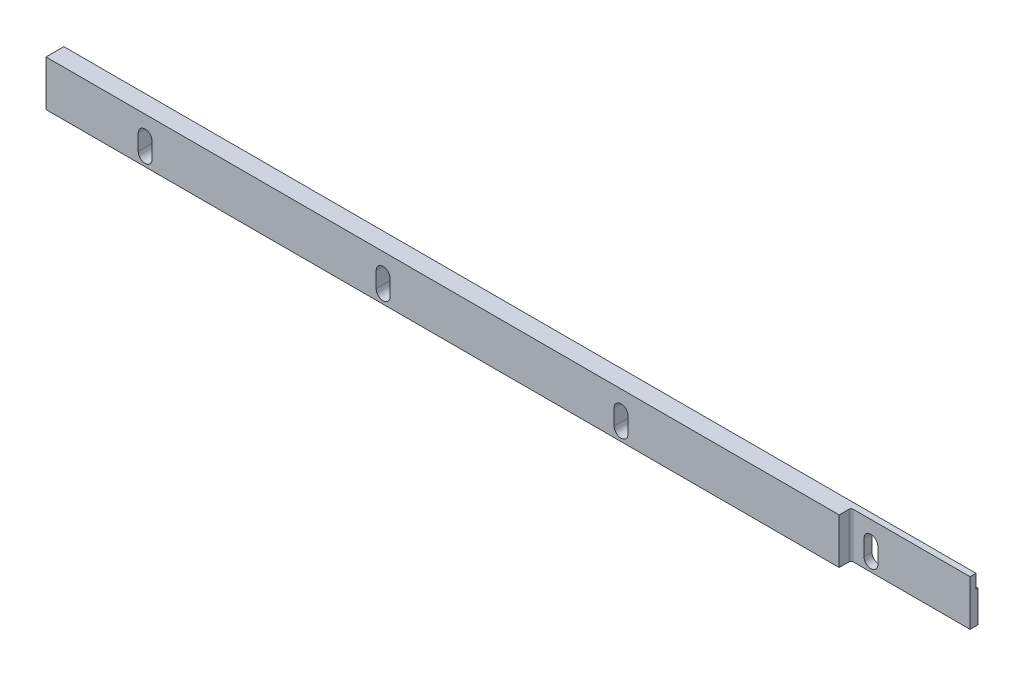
ISO-10303-21;
HEADER;
FILE_DESCRIPTION(('STEP AP214'),'2;1');
FILE_NAME('part.step','',(''),(''),'','','');
FILE_SCHEMA(('AUTOMOTIVE_DESIGN { 1 0 10303 214 1 1 1 1 }'));
ENDSEC;
DATA;
#1=APPLICATION_CONTEXT('core data for automotive mechanical design processes');
#2=APPLICATION_PROTOCOL_DEFINITION('international standard','automotive_design',2000,#1);
#3=PRODUCT_CONTEXT('',#1,'mechanical');
#4=PRODUCT('Part','Part','',(#3));
#5=PRODUCT_RELATED_PRODUCT_CATEGORY('part','',(#4));
#6=PRODUCT_DEFINITION_FORMATION('','',#4);
#7=PRODUCT_DEFINITION_CONTEXT('part definition',#1,'design');
#8=PRODUCT_DEFINITION('design','',#6,#7);
#9=PRODUCT_DEFINITION_SHAPE('','',#8);
#10=(LENGTH_UNIT() NAMED_UNIT(*) SI_UNIT(.MILLI.,.METRE.));
#11=(NAMED_UNIT(*) PLANE_ANGLE_UNIT() SI_UNIT($,.RADIAN.));
#12=(NAMED_UNIT(*) SI_UNIT($,.STERADIAN.) SOLID_ANGLE_UNIT());
#13=UNCERTAINTY_MEASURE_WITH_UNIT(LENGTH_MEASURE(1.E-05),#10,'distance_accuracy_value','');
#14=(GEOMETRIC_REPRESENTATION_CONTEXT(3) GLOBAL_UNCERTAINTY_ASSIGNED_CONTEXT((#13)) GLOBAL_UNIT_ASSIGNED_CONTEXT((#10,
#11,#12)) REPRESENTATION_CONTEXT('',''));
#15=CARTESIAN_POINT('',(0.,0.,0.));
#16=DIRECTION('',(0.,0.,1.));
#17=DIRECTION('',(1.,0.,0.));
#18=AXIS2_PLACEMENT_3D('',#15,#16,#17);
#19=CARTESIAN_POINT('',(0.,-13.3541654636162,5.));
#20=DIRECTION('',(-1.,0.,0.));
#21=DIRECTION('',(0.,-1.,0.));
#22=AXIS2_PLACEMENT_3D('',#19,#20,#21);
#23=PLANE('',#22);
#24=DIRECTION('',(0.,0.,-1.));
#25=VECTOR('',#24,1.);
#26=CARTESIAN_POINT('',(0.,-1.85416546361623,5.));
#27=LINE('',#26,#25);
#28=CARTESIAN_POINT('',(0.,-1.85416546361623,2.));
#29=VERTEX_POINT('',#28);
#30=CARTESIAN_POINT('',(0.,-1.85416546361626,0.5));
#31=VERTEX_POINT('',#30);
#32=EDGE_CURVE('E244',#29,#31,#27,.T.);
#33=ORIENTED_EDGE('',*,*,#32,.F.);
#34=DIRECTION('',(0.,1.,0.));
#35=VECTOR('',#34,1.);
#36=CARTESIAN_POINT('',(0.,-13.3541654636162,2.));
#37=LINE('',#36,#35);
#38=CARTESIAN_POINT('',(0.,-13.3541654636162,2.));
#39=VERTEX_POINT('',#38);
#40=EDGE_CURVE('E231',#39,#29,#37,.T.);
#41=ORIENTED_EDGE('',*,*,#40,.F.);
#42=DIRECTION('',(0.,0.,-1.));
#43=VECTOR('',#42,1.);
#44=CARTESIAN_POINT('',(0.,-13.3541654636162,5.));
#45=LINE('',#44,#43);
#46=CARTESIAN_POINT('',(0.,-13.3541654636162,0.));
#47=VERTEX_POINT('',#46);
#48=EDGE_CURVE('E241',#39,#47,#45,.T.);
#49=ORIENTED_EDGE('',*,*,#48,.T.);
#50=DIRECTION('',(0.,1.,0.));
#51=VECTOR('',#50,1.);
#52=CARTESIAN_POINT('',(0.,-13.3541654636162,0.));
#53=LINE('',#52,#51);
#54=CARTESIAN_POINT('',(0.,-5.35416546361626,0.));
#55=VERTEX_POINT('',#54);
#56=EDGE_CURVE('E472',#47,#55,#53,.T.);
#57=ORIENTED_EDGE('',*,*,#56,.T.);
#58=DIRECTION('',(0.,0.,1.));
#59=VECTOR('',#58,1.);
#60=CARTESIAN_POINT('',(0.,-5.35416546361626,0.));
#61=LINE('',#60,#59);
#62=CARTESIAN_POINT('',(0.,-5.35416546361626,0.5));
#63=VERTEX_POINT('',#62);
#64=EDGE_CURVE('E308',#55,#63,#61,.T.);
#65=ORIENTED_EDGE('',*,*,#64,.T.);
#66=DIRECTION('',(0.,1.,0.));
#67=VECTOR('',#66,1.);
#68=CARTESIAN_POINT('',(0.,-1.85416546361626,0.5));
#69=LINE('',#68,#67);
#70=EDGE_CURVE('E311',#63,#31,#69,.T.);
#71=ORIENTED_EDGE('',*,*,#70,.T.);
#72=EDGE_LOOP('',(#33,#41,#49,#57,#65,#71));
#73=FACE_BOUND('',#72,.T.);
#74=ADVANCED_FACE('F16',(#73),#23,.F.);
#75=CARTESIAN_POINT('',(0.,-1.85416546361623,5.));
#76=DIRECTION('',(0.,-1.,0.));
#77=DIRECTION('',(1.,0.,0.));
#78=AXIS2_PLACEMENT_3D('',#75,#76,#77);
#79=PLANE('',#78);
#80=DIRECTION('',(-1.,0.,0.));
#81=VECTOR('',#80,1.);
#82=CARTESIAN_POINT('',(0.,-1.85416546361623,5.));
#83=LINE('',#82,#81);
#84=CARTESIAN_POINT('',(-30.,-1.85416546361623,5.));
#85=VERTEX_POINT('',#84);
#86=CARTESIAN_POINT('',(-230.,-1.85416546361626,5.));
#87=VERTEX_POINT('',#86);
#88=EDGE_CURVE('E291',#85,#87,#83,.T.);
#89=ORIENTED_EDGE('',*,*,#88,.F.);
#90=DIRECTION('',(0.,0.,1.));
#91=VECTOR('',#90,1.);
#92=CARTESIAN_POINT('',(-30.,-1.85416546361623,5.));
#93=LINE('',#92,#91);
#94=CARTESIAN_POINT('',(-30.,-1.85416546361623,2.5));
#95=VERTEX_POINT('',#94);
#96=EDGE_CURVE('E236',#95,#85,#93,.T.);
#97=ORIENTED_EDGE('',*,*,#96,.F.);
#98=CARTESIAN_POINT('',(-29.5,-1.85416546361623,2.5));
#99=DIRECTION('',(0.,-1.,0.));
#100=DIRECTION('',(1.,0.,0.));
#101=AXIS2_PLACEMENT_3D('',#98,#99,#100);
#102=CIRCLE('',#101,0.5);
#103=CARTESIAN_POINT('',(-29.5,-1.85416546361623,2.));
#104=VERTEX_POINT('',#103);
#105=EDGE_CURVE('E24',#95,#104,#102,.T.);
#106=ORIENTED_EDGE('',*,*,#105,.T.);
#107=DIRECTION('',(-1.,0.,0.));
#108=VECTOR('',#107,1.);
#109=CARTESIAN_POINT('',(0.,-1.85416546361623,2.));
#110=LINE('',#109,#108);
#111=EDGE_CURVE('E292',#29,#104,#110,.T.);
#112=ORIENTED_EDGE('',*,*,#111,.F.);
#113=ORIENTED_EDGE('',*,*,#32,.T.);
#114=DIRECTION('',(-1.,0.,0.));
#115=VECTOR('',#114,1.);
#116=CARTESIAN_POINT('',(0.,-1.85416546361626,0.5));
#117=LINE('',#116,#115);
#118=CARTESIAN_POINT('',(-230.,-1.85416546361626,0.5));
#119=VERTEX_POINT('',#118);
#120=EDGE_CURVE('E318',#31,#119,#117,.T.);
#121=ORIENTED_EDGE('',*,*,#120,.T.);
#122=DIRECTION('',(0.,0.,-1.));
#123=VECTOR('',#122,1.);
#124=CARTESIAN_POINT('',(-230.,-1.85416546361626,5.));
#125=LINE('',#124,#123);
#126=EDGE_CURVE('E255',#87,#119,#125,.T.);
#127=ORIENTED_EDGE('',*,*,#126,.F.);
#128=EDGE_LOOP('',(#89,#97,#106,#112,#113,#121,#127));
#129=FACE_BOUND('',#128,.T.);
#130=ADVANCED_FACE('F289',(#129),#79,.F.);
#131=CARTESIAN_POINT('',(-230.,-13.3541654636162,5.));
#132=DIRECTION('',(1.,0.,0.));
#133=DIRECTION('',(0.,0.,-1.));
#134=AXIS2_PLACEMENT_3D('',#131,#132,#133);
#135=PLANE('',#134);
#136=ORIENTED_EDGE('',*,*,#126,.T.);
#137=DIRECTION('',(0.,1.,0.));
#138=VECTOR('',#137,1.);
#139=CARTESIAN_POINT('',(-230.,-1.85416546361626,0.5));
#140=LINE('',#139,#138);
#141=CARTESIAN_POINT('',(-230.,-5.35416546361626,0.5));
#142=VERTEX_POINT('',#141);
#143=EDGE_CURVE('E312',#142,#119,#140,.T.);
#144=ORIENTED_EDGE('',*,*,#143,.F.);
#145=DIRECTION('',(0.,0.,1.));
#146=VECTOR('',#145,1.);
#147=CARTESIAN_POINT('',(-230.,-5.35416546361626,0.));
#148=LINE('',#147,#146);
#149=CARTESIAN_POINT('',(-230.,-5.35416546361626,0.));
#150=VERTEX_POINT('',#149);
#151=EDGE_CURVE('E307',#150,#142,#148,.T.);
#152=ORIENTED_EDGE('',*,*,#151,.F.);
#153=DIRECTION('',(0.,-1.,0.));
#154=VECTOR('',#153,1.);
#155=CARTESIAN_POINT('',(-230.,-13.3541654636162,0.));
#156=LINE('',#155,#154);
#157=CARTESIAN_POINT('',(-230.,-13.3541654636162,0.));
#158=VERTEX_POINT('',#157);
#159=EDGE_CURVE('E483',#150,#158,#156,.T.);
#160=ORIENTED_EDGE('',*,*,#159,.T.);
#161=DIRECTION('',(0.,0.,-1.));
#162=VECTOR('',#161,1.);
#163=CARTESIAN_POINT('',(-230.,-13.3541654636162,5.));
#164=LINE('',#163,#162);
#165=CARTESIAN_POINT('',(-230.,-13.3541654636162,5.));
#166=VERTEX_POINT('',#165);
#167=EDGE_CURVE('E252',#166,#158,#164,.T.);
#168=ORIENTED_EDGE('',*,*,#167,.F.);
#169=DIRECTION('',(0.,-1.,0.));
#170=VECTOR('',#169,1.);
#171=CARTESIAN_POINT('',(-230.,-13.3541654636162,5.));
#172=LINE('',#171,#170);
#173=EDGE_CURVE('E258',#87,#166,#172,.T.);
#174=ORIENTED_EDGE('',*,*,#173,.F.);
#175=EDGE_LOOP('',(#136,#144,#152,#160,#168,#174));
#176=FACE_BOUND('',#175,.T.);
#177=ADVANCED_FACE('F488',(#176),#135,.F.);
#178=CARTESIAN_POINT('',(0.,-13.3541654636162,5.));
#179=DIRECTION('',(0.,1.,0.));
#180=DIRECTION('',(0.,0.,1.));
#181=AXIS2_PLACEMENT_3D('',#178,#179,#180);
#182=PLANE('',#181);
#183=DIRECTION('',(-1.,0.,0.));
#184=VECTOR('',#183,1.);
#185=CARTESIAN_POINT('',(0.,-13.3541654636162,2.));
#186=LINE('',#185,#184);
#187=CARTESIAN_POINT('',(-29.5,-13.3541654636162,2.));
#188=VERTEX_POINT('',#187);
#189=EDGE_CURVE('E227',#39,#188,#186,.T.);
#190=ORIENTED_EDGE('',*,*,#189,.T.);
#191=CARTESIAN_POINT('',(-29.5,-13.3541654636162,2.5));
#192=DIRECTION('',(0.,1.,0.));
#193=DIRECTION('',(0.,0.,1.));
#194=AXIS2_PLACEMENT_3D('',#191,#192,#193);
#195=CIRCLE('',#194,0.5);
#196=CARTESIAN_POINT('',(-30.,-13.3541654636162,2.5));
#197=VERTEX_POINT('',#196);
#198=EDGE_CURVE('E11',#188,#197,#195,.T.);
#199=ORIENTED_EDGE('',*,*,#198,.T.);
#200=DIRECTION('',(0.,0.,1.));
#201=VECTOR('',#200,1.);
#202=CARTESIAN_POINT('',(-30.,-13.3541654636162,5.));
#203=LINE('',#202,#201);
#204=CARTESIAN_POINT('',(-30.,-13.3541654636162,5.));
#205=VERTEX_POINT('',#204);
#206=EDGE_CURVE('E235',#197,#205,#203,.T.);
#207=ORIENTED_EDGE('',*,*,#206,.T.);
#208=DIRECTION('',(1.,0.,0.));
#209=VECTOR('',#208,1.);
#210=CARTESIAN_POINT('',(0.,-13.3541654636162,5.));
#211=LINE('',#210,#209);
#212=EDGE_CURVE('E253',#166,#205,#211,.T.);
#213=ORIENTED_EDGE('',*,*,#212,.F.);
#214=ORIENTED_EDGE('',*,*,#167,.T.);
#215=DIRECTION('',(1.,0.,0.));
#216=VECTOR('',#215,1.);
#217=CARTESIAN_POINT('',(0.,-13.3541654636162,0.));
#218=LINE('',#217,#216);
#219=EDGE_CURVE('E250',#158,#47,#218,.T.);
#220=ORIENTED_EDGE('',*,*,#219,.T.);
#221=ORIENTED_EDGE('',*,*,#48,.F.);
#222=EDGE_LOOP('',(#190,#199,#207,#213,#214,#220,#221));
#223=FACE_BOUND('',#222,.T.);
#224=ADVANCED_FACE('F247',(#223),#182,.F.);
#225=CARTESIAN_POINT('',(0.,0.,5.));
#226=DIRECTION('',(0.,0.,1.));
#227=DIRECTION('',(1.,0.,0.));
#228=AXIS2_PLACEMENT_3D('',#225,#226,#227);
#229=PLANE('',#228);
#230=DIRECTION('',(0.,1.,0.));
#231=VECTOR('',#230,1.);
#232=CARTESIAN_POINT('',(-30.,-13.3541654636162,5.));
#233=LINE('',#232,#231);
#234=EDGE_CURVE('E245',#205,#85,#233,.T.);
#235=ORIENTED_EDGE('',*,*,#234,.T.);
#236=ORIENTED_EDGE('',*,*,#88,.T.);
#237=ORIENTED_EDGE('',*,*,#173,.T.);
#238=ORIENTED_EDGE('',*,*,#212,.T.);
#239=EDGE_LOOP('',(#235,#236,#237,#238));
#240=FACE_BOUND('',#239,.T.);
#241=CARTESIAN_POINT('',(-205.,-6.85416546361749,5.));
#242=DIRECTION('',(0.,0.,1.));
#243=DIRECTION('',(1.,0.,0.));
#244=AXIS2_PLACEMENT_3D('',#241,#242,#243);
#245=CIRCLE('',#244,1.75000000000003);
#246=CARTESIAN_POINT('',(-203.25,-6.85416546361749,5.));
#247=VERTEX_POINT('',#246);
#248=CARTESIAN_POINT('',(-206.75,-6.85416546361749,5.));
#249=VERTEX_POINT('',#248);
#250=EDGE_CURVE('E356',#247,#249,#245,.T.);
#251=ORIENTED_EDGE('',*,*,#250,.F.);
#252=DIRECTION('',(0.,1.,0.));
#253=VECTOR('',#252,1.);
#254=CARTESIAN_POINT('',(-203.25,-6.85416546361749,5.));
#255=LINE('',#254,#253);
#256=CARTESIAN_POINT('',(-203.25,-10.8541654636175,5.));
#257=VERTEX_POINT('',#256);
#258=EDGE_CURVE('E378',#257,#247,#255,.T.);
#259=ORIENTED_EDGE('',*,*,#258,.F.);
#260=CARTESIAN_POINT('',(-205.,-10.8541654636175,5.));
#261=DIRECTION('',(0.,0.,1.));
#262=DIRECTION('',(1.,0.,0.));
#263=AXIS2_PLACEMENT_3D('',#260,#261,#262);
#264=CIRCLE('',#263,1.75000000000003);
#265=CARTESIAN_POINT('',(-206.75,-10.8541654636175,5.));
#266=VERTEX_POINT('',#265);
#267=EDGE_CURVE('E375',#266,#257,#264,.T.);
#268=ORIENTED_EDGE('',*,*,#267,.F.);
#269=DIRECTION('',(0.,-1.,0.));
#270=VECTOR('',#269,1.);
#271=CARTESIAN_POINT('',(-206.75,-6.85416546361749,5.));
#272=LINE('',#271,#270);
#273=EDGE_CURVE('E372',#249,#266,#272,.T.);
#274=ORIENTED_EDGE('',*,*,#273,.F.);
#275=EDGE_LOOP('',(#251,#259,#268,#274));
#276=FACE_BOUND('',#275,.T.);
#277=CARTESIAN_POINT('',(-145.,-6.85416546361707,5.));
#278=DIRECTION('',(0.,0.,1.));
#279=DIRECTION('',(1.,0.,0.));
#280=AXIS2_PLACEMENT_3D('',#277,#278,#279);
#281=CIRCLE('',#280,1.75000000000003);
#282=CARTESIAN_POINT('',(-143.25,-6.85416546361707,5.));
#283=VERTEX_POINT('',#282);
#284=CARTESIAN_POINT('',(-146.75,-6.85416546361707,5.));
#285=VERTEX_POINT('',#284);
#286=EDGE_CURVE('E383',#283,#285,#281,.T.);
#287=ORIENTED_EDGE('',*,*,#286,.F.);
#288=DIRECTION('',(0.,1.,0.));
#289=VECTOR('',#288,1.);
#290=CARTESIAN_POINT('',(-143.25,-6.85416546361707,5.));
#291=LINE('',#290,#289);
#292=CARTESIAN_POINT('',(-143.25,-10.8541654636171,5.));
#293=VERTEX_POINT('',#292);
#294=EDGE_CURVE('E411',#293,#283,#291,.T.);
#295=ORIENTED_EDGE('',*,*,#294,.F.);
#296=CARTESIAN_POINT('',(-145.,-10.8541654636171,5.));
#297=DIRECTION('',(0.,0.,1.));
#298=DIRECTION('',(1.,0.,0.));
#299=AXIS2_PLACEMENT_3D('',#296,#297,#298);
#300=CIRCLE('',#299,1.75000000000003);
#301=CARTESIAN_POINT('',(-146.75,-10.8541654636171,5.));
#302=VERTEX_POINT('',#301);
#303=EDGE_CURVE('E408',#302,#293,#300,.T.);
#304=ORIENTED_EDGE('',*,*,#303,.F.);
#305=DIRECTION('',(0.,-1.,0.));
#306=VECTOR('',#305,1.);
#307=CARTESIAN_POINT('',(-146.75,-6.85416546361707,5.));
#308=LINE('',#307,#306);
#309=EDGE_CURVE('E405',#285,#302,#308,.T.);
#310=ORIENTED_EDGE('',*,*,#309,.F.);
#311=EDGE_LOOP('',(#287,#295,#304,#310));
#312=FACE_BOUND('',#311,.T.);
#313=CARTESIAN_POINT('',(-85.,-6.85416546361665,5.));
#314=DIRECTION('',(0.,0.,1.));
#315=DIRECTION('',(1.,0.,0.));
#316=AXIS2_PLACEMENT_3D('',#313,#314,#315);
#317=CIRCLE('',#316,1.75);
#318=CARTESIAN_POINT('',(-83.25,-6.85416546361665,5.));
#319=VERTEX_POINT('',#318);
#320=CARTESIAN_POINT('',(-86.75,-6.85416546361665,5.));
#321=VERTEX_POINT('',#320);
#322=EDGE_CURVE('E416',#319,#321,#317,.T.);
#323=ORIENTED_EDGE('',*,*,#322,.F.);
#324=DIRECTION('',(0.,1.,0.));
#325=VECTOR('',#324,1.);
#326=CARTESIAN_POINT('',(-83.25,-6.85416546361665,5.));
#327=LINE('',#326,#325);
#328=CARTESIAN_POINT('',(-83.25,-10.8541654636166,5.));
#329=VERTEX_POINT('',#328);
#330=EDGE_CURVE('E444',#329,#319,#327,.T.);
#331=ORIENTED_EDGE('',*,*,#330,.F.);
#332=CARTESIAN_POINT('',(-85.,-10.8541654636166,5.));
#333=DIRECTION('',(0.,0.,1.));
#334=DIRECTION('',(1.,0.,0.));
#335=AXIS2_PLACEMENT_3D('',#332,#333,#334);
#336=CIRCLE('',#335,1.75);
#337=CARTESIAN_POINT('',(-86.75,-10.8541654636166,5.));
#338=VERTEX_POINT('',#337);
#339=EDGE_CURVE('E441',#338,#329,#336,.T.);
#340=ORIENTED_EDGE('',*,*,#339,.F.);
#341=DIRECTION('',(0.,-1.,0.));
#342=VECTOR('',#341,1.);
#343=CARTESIAN_POINT('',(-86.75,-6.85416546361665,5.));
#344=LINE('',#343,#342);
#345=EDGE_CURVE('E438',#321,#338,#344,.T.);
#346=ORIENTED_EDGE('',*,*,#345,.F.);
#347=EDGE_LOOP('',(#323,#331,#340,#346));
#348=FACE_BOUND('',#347,.T.);
#349=ADVANCED_FACE('F504',(#240,#276,#312,#348),#229,.T.);
#350=CARTESIAN_POINT('',(0.,0.,0.));
#351=DIRECTION('',(0.,0.,1.));
#352=DIRECTION('',(1.,0.,0.));
#353=AXIS2_PLACEMENT_3D('',#350,#351,#352);
#354=PLANE('',#353);
#355=ORIENTED_EDGE('',*,*,#159,.F.);
#356=DIRECTION('',(-1.,0.,0.));
#357=VECTOR('',#356,1.);
#358=CARTESIAN_POINT('',(0.,-5.35416546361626,0.));
#359=LINE('',#358,#357);
#360=CARTESIAN_POINT('',(-205.901387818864,-5.35416546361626,0.));
#361=VERTEX_POINT('',#360);
#362=EDGE_CURVE('E314',#361,#150,#359,.T.);
#363=ORIENTED_EDGE('',*,*,#362,.F.);
#364=CARTESIAN_POINT('',(-205.,-6.85416546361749,0.));
#365=DIRECTION('',(0.,0.,1.));
#366=DIRECTION('',(1.,0.,0.));
#367=AXIS2_PLACEMENT_3D('',#364,#365,#366);
#368=CIRCLE('',#367,1.75000000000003);
#369=CARTESIAN_POINT('',(-206.75,-6.85416546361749,0.));
#370=VERTEX_POINT('',#369);
#371=EDGE_CURVE('E361',#361,#370,#368,.T.);
#372=ORIENTED_EDGE('',*,*,#371,.T.);
#373=DIRECTION('',(0.,-1.,0.));
#374=VECTOR('',#373,1.);
#375=CARTESIAN_POINT('',(-206.75,-6.85416546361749,0.));
#376=LINE('',#375,#374);
#377=CARTESIAN_POINT('',(-206.75,-10.8541654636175,0.));
#378=VERTEX_POINT('',#377);
#379=EDGE_CURVE('E360',#370,#378,#376,.T.);
#380=ORIENTED_EDGE('',*,*,#379,.T.);
#381=CARTESIAN_POINT('',(-205.,-10.8541654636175,0.));
#382=DIRECTION('',(0.,0.,1.));
#383=DIRECTION('',(1.,0.,0.));
#384=AXIS2_PLACEMENT_3D('',#381,#382,#383);
#385=CIRCLE('',#384,1.75000000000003);
#386=CARTESIAN_POINT('',(-203.25,-10.8541654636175,0.));
#387=VERTEX_POINT('',#386);
#388=EDGE_CURVE('E364',#378,#387,#385,.T.);
#389=ORIENTED_EDGE('',*,*,#388,.T.);
#390=DIRECTION('',(0.,1.,0.));
#391=VECTOR('',#390,1.);
#392=CARTESIAN_POINT('',(-203.25,-6.85416546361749,0.));
#393=LINE('',#392,#391);
#394=CARTESIAN_POINT('',(-203.25,-6.85416546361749,0.));
#395=VERTEX_POINT('',#394);
#396=EDGE_CURVE('E367',#387,#395,#393,.T.);
#397=ORIENTED_EDGE('',*,*,#396,.T.);
#398=CARTESIAN_POINT('',(-204.098612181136,-5.35416546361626,0.));
#399=VERTEX_POINT('',#398);
#400=EDGE_CURVE('E357',#395,#399,#368,.T.);
#401=ORIENTED_EDGE('',*,*,#400,.T.);
#402=CARTESIAN_POINT('',(-145.901387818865,-5.35416546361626,0.));
#403=VERTEX_POINT('',#402);
#404=EDGE_CURVE('E543',#403,#399,#359,.T.);
#405=ORIENTED_EDGE('',*,*,#404,.F.);
#406=CARTESIAN_POINT('',(-145.,-6.85416546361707,0.));
#407=DIRECTION('',(0.,0.,1.));
#408=DIRECTION('',(1.,0.,0.));
#409=AXIS2_PLACEMENT_3D('',#406,#407,#408);
#410=CIRCLE('',#409,1.75000000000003);
#411=CARTESIAN_POINT('',(-146.75,-6.85416546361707,0.));
#412=VERTEX_POINT('',#411);
#413=EDGE_CURVE('E394',#403,#412,#410,.T.);
#414=ORIENTED_EDGE('',*,*,#413,.T.);
#415=DIRECTION('',(0.,-1.,0.));
#416=VECTOR('',#415,1.);
#417=CARTESIAN_POINT('',(-146.75,-6.85416546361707,0.));
#418=LINE('',#417,#416);
#419=CARTESIAN_POINT('',(-146.75,-10.8541654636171,0.));
#420=VERTEX_POINT('',#419);
#421=EDGE_CURVE('E393',#412,#420,#418,.T.);
#422=ORIENTED_EDGE('',*,*,#421,.T.);
#423=CARTESIAN_POINT('',(-145.,-10.8541654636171,0.));
#424=DIRECTION('',(0.,0.,1.));
#425=DIRECTION('',(1.,0.,0.));
#426=AXIS2_PLACEMENT_3D('',#423,#424,#425);
#427=CIRCLE('',#426,1.75000000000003);
#428=CARTESIAN_POINT('',(-143.25,-10.8541654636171,0.));
#429=VERTEX_POINT('',#428);
#430=EDGE_CURVE('E397',#420,#429,#427,.T.);
#431=ORIENTED_EDGE('',*,*,#430,.T.);
#432=DIRECTION('',(0.,1.,0.));
#433=VECTOR('',#432,1.);
#434=CARTESIAN_POINT('',(-143.25,-6.85416546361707,0.));
#435=LINE('',#434,#433);
#436=CARTESIAN_POINT('',(-143.25,-6.85416546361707,0.));
#437=VERTEX_POINT('',#436);
#438=EDGE_CURVE('E400',#429,#437,#435,.T.);
#439=ORIENTED_EDGE('',*,*,#438,.T.);
#440=CARTESIAN_POINT('',(-144.098612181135,-5.35416546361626,0.));
#441=VERTEX_POINT('',#440);
#442=EDGE_CURVE('E390',#437,#441,#410,.T.);
#443=ORIENTED_EDGE('',*,*,#442,.T.);
#444=CARTESIAN_POINT('',(-85.9013878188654,-5.35416546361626,0.));
#445=VERTEX_POINT('',#444);
#446=EDGE_CURVE('E530',#445,#441,#359,.T.);
#447=ORIENTED_EDGE('',*,*,#446,.F.);
#448=CARTESIAN_POINT('',(-85.,-6.85416546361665,0.));
#449=DIRECTION('',(0.,0.,1.));
#450=DIRECTION('',(1.,0.,0.));
#451=AXIS2_PLACEMENT_3D('',#448,#449,#450);
#452=CIRCLE('',#451,1.75);
#453=CARTESIAN_POINT('',(-86.75,-6.85416546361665,0.));
#454=VERTEX_POINT('',#453);
#455=EDGE_CURVE('E427',#445,#454,#452,.T.);
#456=ORIENTED_EDGE('',*,*,#455,.T.);
#457=DIRECTION('',(0.,-1.,0.));
#458=VECTOR('',#457,1.);
#459=CARTESIAN_POINT('',(-86.75,-6.85416546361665,0.));
#460=LINE('',#459,#458);
#461=CARTESIAN_POINT('',(-86.75,-10.8541654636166,0.));
#462=VERTEX_POINT('',#461);
#463=EDGE_CURVE('E426',#454,#462,#460,.T.);
#464=ORIENTED_EDGE('',*,*,#463,.T.);
#465=CARTESIAN_POINT('',(-85.,-10.8541654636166,0.));
#466=DIRECTION('',(0.,0.,1.));
#467=DIRECTION('',(1.,0.,0.));
#468=AXIS2_PLACEMENT_3D('',#465,#466,#467);
#469=CIRCLE('',#468,1.75);
#470=CARTESIAN_POINT('',(-83.25,-10.8541654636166,0.));
#471=VERTEX_POINT('',#470);
#472=EDGE_CURVE('E430',#462,#471,#469,.T.);
#473=ORIENTED_EDGE('',*,*,#472,.T.);
#474=DIRECTION('',(0.,1.,0.));
#475=VECTOR('',#474,1.);
#476=CARTESIAN_POINT('',(-83.25,-6.85416546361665,0.));
#477=LINE('',#476,#475);
#478=CARTESIAN_POINT('',(-83.25,-6.85416546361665,0.));
#479=VERTEX_POINT('',#478);
#480=EDGE_CURVE('E433',#471,#479,#477,.T.);
#481=ORIENTED_EDGE('',*,*,#480,.T.);
#482=CARTESIAN_POINT('',(-84.0986121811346,-5.35416546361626,0.));
#483=VERTEX_POINT('',#482);
#484=EDGE_CURVE('E423',#479,#483,#452,.T.);
#485=ORIENTED_EDGE('',*,*,#484,.T.);
#486=CARTESIAN_POINT('',(-25.9013878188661,-5.35416546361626,0.));
#487=VERTEX_POINT('',#486);
#488=EDGE_CURVE('E329',#487,#483,#359,.T.);
#489=ORIENTED_EDGE('',*,*,#488,.F.);
#490=CARTESIAN_POINT('',(-25.,-6.85416546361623,0.));
#491=DIRECTION('',(0.,0.,1.));
#492=DIRECTION('',(1.,0.,0.));
#493=AXIS2_PLACEMENT_3D('',#490,#491,#492);
#494=CIRCLE('',#493,1.75);
#495=CARTESIAN_POINT('',(-26.75,-6.85416546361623,0.));
#496=VERTEX_POINT('',#495);
#497=EDGE_CURVE('E449',#487,#496,#494,.T.);
#498=ORIENTED_EDGE('',*,*,#497,.T.);
#499=DIRECTION('',(0.,-1.,0.));
#500=VECTOR('',#499,1.);
#501=CARTESIAN_POINT('',(-26.75,-6.85416546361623,0.));
#502=LINE('',#501,#500);
#503=CARTESIAN_POINT('',(-26.75,-10.8541654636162,0.));
#504=VERTEX_POINT('',#503);
#505=EDGE_CURVE('E459',#496,#504,#502,.T.);
#506=ORIENTED_EDGE('',*,*,#505,.T.);
#507=CARTESIAN_POINT('',(-25.,-10.8541654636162,0.));
#508=DIRECTION('',(0.,0.,1.));
#509=DIRECTION('',(1.,0.,0.));
#510=AXIS2_PLACEMENT_3D('',#507,#508,#509);
#511=CIRCLE('',#510,1.75);
#512=CARTESIAN_POINT('',(-23.25,-10.8541654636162,0.));
#513=VERTEX_POINT('',#512);
#514=EDGE_CURVE('E462',#504,#513,#511,.T.);
#515=ORIENTED_EDGE('',*,*,#514,.T.);
#516=DIRECTION('',(0.,1.,0.));
#517=VECTOR('',#516,1.);
#518=CARTESIAN_POINT('',(-23.25,-6.85416546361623,0.));
#519=LINE('',#518,#517);
#520=CARTESIAN_POINT('',(-23.25,-6.85416546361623,0.));
#521=VERTEX_POINT('',#520);
#522=EDGE_CURVE('E465',#513,#521,#519,.T.);
#523=ORIENTED_EDGE('',*,*,#522,.T.);
#524=CARTESIAN_POINT('',(-24.098612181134,-5.35416546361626,0.));
#525=VERTEX_POINT('',#524);
#526=EDGE_CURVE('E456',#521,#525,#494,.T.);
#527=ORIENTED_EDGE('',*,*,#526,.T.);
#528=EDGE_CURVE('E327',#55,#525,#359,.T.);
#529=ORIENTED_EDGE('',*,*,#528,.F.);
#530=ORIENTED_EDGE('',*,*,#56,.F.);
#531=ORIENTED_EDGE('',*,*,#219,.F.);
#532=EDGE_LOOP('',(#355,#363,#372,#380,#389,#397,#401,#405,#414,#422,#431,#439,#443,#447,#456,
#464,#473,#481,#485,#489,#498,#506,#515,#523,#527,#529,#530,#531));
#533=FACE_BOUND('',#532,.T.);
#534=ADVANCED_FACE('F494',(#533),#354,.F.);
#535=CARTESIAN_POINT('',(-25.,-6.85416546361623,0.));
#536=DIRECTION('',(0.,0.,1.));
#537=DIRECTION('',(1.,0.,0.));
#538=AXIS2_PLACEMENT_3D('',#535,#536,#537);
#539=CYLINDRICAL_SURFACE('',#538,1.75);
#540=DIRECTION('',(0.,0.,1.));
#541=VECTOR('',#540,1.);
#542=CARTESIAN_POINT('',(-23.25,-6.85416546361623,0.));
#543=LINE('',#542,#541);
#544=CARTESIAN_POINT('',(-23.25,-6.85416546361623,2.));
#545=VERTEX_POINT('',#544);
#546=EDGE_CURVE('E469',#521,#545,#543,.T.);
#547=ORIENTED_EDGE('',*,*,#546,.T.);
#548=CARTESIAN_POINT('',(-25.,-6.85416546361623,2.));
#549=DIRECTION('',(0.,0.,-1.));
#550=DIRECTION('',(-1.,0.,0.));
#551=AXIS2_PLACEMENT_3D('',#548,#549,#550);
#552=CIRCLE('',#551,1.75);
#553=CARTESIAN_POINT('',(-26.75,-6.85416546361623,2.));
#554=VERTEX_POINT('',#553);
#555=EDGE_CURVE('E304',#545,#554,#552,.F.);
#556=ORIENTED_EDGE('',*,*,#555,.T.);
#557=DIRECTION('',(0.,0.,1.));
#558=VECTOR('',#557,1.);
#559=CARTESIAN_POINT('',(-26.75,-6.85416546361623,0.));
#560=LINE('',#559,#558);
#561=EDGE_CURVE('E468',#496,#554,#560,.T.);
#562=ORIENTED_EDGE('',*,*,#561,.F.);
#563=ORIENTED_EDGE('',*,*,#497,.F.);
#564=DIRECTION('',(0.,0.,1.));
#565=VECTOR('',#564,1.);
#566=CARTESIAN_POINT('',(-25.9013878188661,-5.35416546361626,0.));
#567=LINE('',#566,#565);
#568=CARTESIAN_POINT('',(-25.9013878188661,-5.35416546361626,0.5));
#569=VERTEX_POINT('',#568);
#570=EDGE_CURVE('E341',#487,#569,#567,.T.);
#571=ORIENTED_EDGE('',*,*,#570,.T.);
#572=CARTESIAN_POINT('',(-25.,-6.85416546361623,0.5));
#573=DIRECTION('',(0.,0.,1.));
#574=DIRECTION('',(0.,-1.,0.));
#575=AXIS2_PLACEMENT_3D('',#572,#573,#574);
#576=CIRCLE('',#575,1.75);
#577=CARTESIAN_POINT('',(-24.098612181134,-5.35416546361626,0.5));
#578=VERTEX_POINT('',#577);
#579=EDGE_CURVE('E353',#569,#578,#576,.F.);
#580=ORIENTED_EDGE('',*,*,#579,.T.);
#581=DIRECTION('',(0.,0.,1.));
#582=VECTOR('',#581,1.);
#583=CARTESIAN_POINT('',(-24.098612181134,-5.35416546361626,0.));
#584=LINE('',#583,#582);
#585=EDGE_CURVE('E344',#578,#525,#584,.F.);
#586=ORIENTED_EDGE('',*,*,#585,.T.);
#587=ORIENTED_EDGE('',*,*,#526,.F.);
#588=EDGE_LOOP('',(#547,#556,#562,#563,#571,#580,#586,#587));
#589=FACE_BOUND('',#588,.T.);
#590=ADVANCED_FACE('F579',(#589),#539,.F.);
#591=CARTESIAN_POINT('',(-23.25,-6.85416546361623,0.));
#592=DIRECTION('',(1.,0.,0.));
#593=DIRECTION('',(0.,0.,-1.));
#594=AXIS2_PLACEMENT_3D('',#591,#592,#593);
#595=PLANE('',#594);
#596=DIRECTION('',(0.,0.,1.));
#597=VECTOR('',#596,1.);
#598=CARTESIAN_POINT('',(-23.25,-10.8541654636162,0.));
#599=LINE('',#598,#597);
#600=CARTESIAN_POINT('',(-23.25,-10.8541654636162,2.));
#601=VERTEX_POINT('',#600);
#602=EDGE_CURVE('E473',#513,#601,#599,.T.);
#603=ORIENTED_EDGE('',*,*,#602,.T.);
#604=DIRECTION('',(0.,1.,0.));
#605=VECTOR('',#604,1.);
#606=CARTESIAN_POINT('',(-23.25,-6.85416546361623,2.));
#607=LINE('',#606,#605);
#608=EDGE_CURVE('E301',#601,#545,#607,.T.);
#609=ORIENTED_EDGE('',*,*,#608,.T.);
#610=ORIENTED_EDGE('',*,*,#546,.F.);
#611=ORIENTED_EDGE('',*,*,#522,.F.);
#612=EDGE_LOOP('',(#603,#609,#610,#611));
#613=FACE_BOUND('',#612,.T.);
#614=ADVANCED_FACE('F583',(#613),#595,.F.);
#615=CARTESIAN_POINT('',(-25.,-10.8541654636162,0.));
#616=DIRECTION('',(0.,0.,1.));
#617=DIRECTION('',(1.,0.,0.));
#618=AXIS2_PLACEMENT_3D('',#615,#616,#617);
#619=CYLINDRICAL_SURFACE('',#618,1.75);
#620=DIRECTION('',(0.,0.,1.));
#621=VECTOR('',#620,1.);
#622=CARTESIAN_POINT('',(-26.75,-10.8541654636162,0.));
#623=LINE('',#622,#621);
#624=CARTESIAN_POINT('',(-26.75,-10.8541654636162,2.));
#625=VERTEX_POINT('',#624);
#626=EDGE_CURVE('E476',#504,#625,#623,.T.);
#627=ORIENTED_EDGE('',*,*,#626,.T.);
#628=CARTESIAN_POINT('',(-25.,-10.8541654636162,2.));
#629=DIRECTION('',(0.,0.,-1.));
#630=DIRECTION('',(-1.,0.,0.));
#631=AXIS2_PLACEMENT_3D('',#628,#629,#630);
#632=CIRCLE('',#631,1.75);
#633=EDGE_CURVE('E297',#625,#601,#632,.F.);
#634=ORIENTED_EDGE('',*,*,#633,.T.);
#635=ORIENTED_EDGE('',*,*,#602,.F.);
#636=ORIENTED_EDGE('',*,*,#514,.F.);
#637=EDGE_LOOP('',(#627,#634,#635,#636));
#638=FACE_BOUND('',#637,.T.);
#639=ADVANCED_FACE('F588',(#638),#619,.F.);
#640=CARTESIAN_POINT('',(-26.75,-6.85416546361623,0.));
#641=DIRECTION('',(-1.,0.,0.));
#642=DIRECTION('',(0.,0.,1.));
#643=AXIS2_PLACEMENT_3D('',#640,#641,#642);
#644=PLANE('',#643);
#645=ORIENTED_EDGE('',*,*,#561,.T.);
#646=DIRECTION('',(0.,-1.,0.));
#647=VECTOR('',#646,1.);
#648=CARTESIAN_POINT('',(-26.75,-6.85416546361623,2.));
#649=LINE('',#648,#647);
#650=EDGE_CURVE('E275',#554,#625,#649,.T.);
#651=ORIENTED_EDGE('',*,*,#650,.T.);
#652=ORIENTED_EDGE('',*,*,#626,.F.);
#653=ORIENTED_EDGE('',*,*,#505,.F.);
#654=EDGE_LOOP('',(#645,#651,#652,#653));
#655=FACE_BOUND('',#654,.T.);
#656=ADVANCED_FACE('F585',(#655),#644,.F.);
#657=CARTESIAN_POINT('',(-85.,-6.85416546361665,0.));
#658=DIRECTION('',(0.,0.,1.));
#659=DIRECTION('',(1.,0.,0.));
#660=AXIS2_PLACEMENT_3D('',#657,#658,#659);
#661=CYLINDRICAL_SURFACE('',#660,1.75);
#662=CARTESIAN_POINT('',(-85.,-6.85416546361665,0.5));
#663=DIRECTION('',(0.,0.,1.));
#664=DIRECTION('',(0.,-1.,0.));
#665=AXIS2_PLACEMENT_3D('',#662,#663,#664);
#666=CIRCLE('',#665,1.75);
#667=CARTESIAN_POINT('',(-85.9013878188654,-5.35416546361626,0.5));
#668=VERTEX_POINT('',#667);
#669=CARTESIAN_POINT('',(-84.0986121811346,-5.35416546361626,0.5));
#670=VERTEX_POINT('',#669);
#671=EDGE_CURVE('E350',#668,#670,#666,.F.);
#672=ORIENTED_EDGE('',*,*,#671,.T.);
#673=DIRECTION('',(0.,0.,1.));
#674=VECTOR('',#673,1.);
#675=CARTESIAN_POINT('',(-84.0986121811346,-5.35416546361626,0.));
#676=LINE('',#675,#674);
#677=EDGE_CURVE('E338',#670,#483,#676,.F.);
#678=ORIENTED_EDGE('',*,*,#677,.T.);
#679=ORIENTED_EDGE('',*,*,#484,.F.);
#680=DIRECTION('',(0.,0.,1.));
#681=VECTOR('',#680,1.);
#682=CARTESIAN_POINT('',(-83.25,-6.85416546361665,0.));
#683=LINE('',#682,#681);
#684=EDGE_CURVE('E447',#479,#319,#683,.T.);
#685=ORIENTED_EDGE('',*,*,#684,.T.);
#686=ORIENTED_EDGE('',*,*,#322,.T.);
#687=DIRECTION('',(0.,0.,1.));
#688=VECTOR('',#687,1.);
#689=CARTESIAN_POINT('',(-86.75,-6.85416546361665,0.));
#690=LINE('',#689,#688);
#691=EDGE_CURVE('E436',#454,#321,#690,.T.);
#692=ORIENTED_EDGE('',*,*,#691,.F.);
#693=ORIENTED_EDGE('',*,*,#455,.F.);
#694=DIRECTION('',(0.,0.,1.));
#695=VECTOR('',#694,1.);
#696=CARTESIAN_POINT('',(-85.9013878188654,-5.35416546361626,0.));
#697=LINE('',#696,#695);
#698=EDGE_CURVE('E335',#445,#668,#697,.T.);
#699=ORIENTED_EDGE('',*,*,#698,.T.);
#700=EDGE_LOOP('',(#672,#678,#679,#685,#686,#692,#693,#699));
#701=FACE_BOUND('',#700,.T.);
#702=ADVANCED_FACE('F522',(#701),#661,.F.);
#703=CARTESIAN_POINT('',(-83.25,-6.85416546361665,0.));
#704=DIRECTION('',(1.,0.,0.));
#705=DIRECTION('',(0.,0.,-1.));
#706=AXIS2_PLACEMENT_3D('',#703,#704,#705);
#707=PLANE('',#706);
#708=ORIENTED_EDGE('',*,*,#330,.T.);
#709=ORIENTED_EDGE('',*,*,#684,.F.);
#710=ORIENTED_EDGE('',*,*,#480,.F.);
#711=DIRECTION('',(0.,0.,1.));
#712=VECTOR('',#711,1.);
#713=CARTESIAN_POINT('',(-83.25,-10.8541654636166,0.));
#714=LINE('',#713,#712);
#715=EDGE_CURVE('E450',#471,#329,#714,.T.);
#716=ORIENTED_EDGE('',*,*,#715,.T.);
#717=EDGE_LOOP('',(#708,#709,#710,#716));
#718=FACE_BOUND('',#717,.T.);
#719=ADVANCED_FACE('F553',(#718),#707,.F.);
#720=CARTESIAN_POINT('',(-85.,-10.8541654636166,0.));
#721=DIRECTION('',(0.,0.,1.));
#722=DIRECTION('',(1.,0.,0.));
#723=AXIS2_PLACEMENT_3D('',#720,#721,#722);
#724=CYLINDRICAL_SURFACE('',#723,1.75);
#725=ORIENTED_EDGE('',*,*,#339,.T.);
#726=ORIENTED_EDGE('',*,*,#715,.F.);
#727=ORIENTED_EDGE('',*,*,#472,.F.);
#728=DIRECTION('',(0.,0.,1.));
#729=VECTOR('',#728,1.);
#730=CARTESIAN_POINT('',(-86.75,-10.8541654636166,0.));
#731=LINE('',#730,#729);
#732=EDGE_CURVE('E452',#462,#338,#731,.T.);
#733=ORIENTED_EDGE('',*,*,#732,.T.);
#734=EDGE_LOOP('',(#725,#726,#727,#733));
#735=FACE_BOUND('',#734,.T.);
#736=ADVANCED_FACE('F555',(#735),#724,.F.);
#737=CARTESIAN_POINT('',(-86.75,-6.85416546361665,0.));
#738=DIRECTION('',(-1.,0.,0.));
#739=DIRECTION('',(0.,0.,1.));
#740=AXIS2_PLACEMENT_3D('',#737,#738,#739);
#741=PLANE('',#740);
#742=ORIENTED_EDGE('',*,*,#345,.T.);
#743=ORIENTED_EDGE('',*,*,#732,.F.);
#744=ORIENTED_EDGE('',*,*,#463,.F.);
#745=ORIENTED_EDGE('',*,*,#691,.T.);
#746=EDGE_LOOP('',(#742,#743,#744,#745));
#747=FACE_BOUND('',#746,.T.);
#748=ADVANCED_FACE('F527',(#747),#741,.F.);
#749=CARTESIAN_POINT('',(-145.,-6.85416546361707,0.));
#750=DIRECTION('',(0.,0.,1.));
#751=DIRECTION('',(1.,0.,0.));
#752=AXIS2_PLACEMENT_3D('',#749,#750,#751);
#753=CYLINDRICAL_SURFACE('',#752,1.75000000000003);
#754=CARTESIAN_POINT('',(-145.,-6.85416546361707,0.5));
#755=DIRECTION('',(0.,0.,1.));
#756=DIRECTION('',(0.,-1.,0.));
#757=AXIS2_PLACEMENT_3D('',#754,#755,#756);
#758=CIRCLE('',#757,1.75000000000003);
#759=CARTESIAN_POINT('',(-145.901387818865,-5.35416546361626,0.5));
#760=VERTEX_POINT('',#759);
#761=CARTESIAN_POINT('',(-144.098612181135,-5.35416546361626,0.5));
#762=VERTEX_POINT('',#761);
#763=EDGE_CURVE('E347',#760,#762,#758,.F.);
#764=ORIENTED_EDGE('',*,*,#763,.T.);
#765=DIRECTION('',(0.,0.,1.));
#766=VECTOR('',#765,1.);
#767=CARTESIAN_POINT('',(-144.098612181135,-5.35416546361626,0.));
#768=LINE('',#767,#766);
#769=EDGE_CURVE('E332',#762,#441,#768,.F.);
#770=ORIENTED_EDGE('',*,*,#769,.T.);
#771=ORIENTED_EDGE('',*,*,#442,.F.);
#772=DIRECTION('',(0.,0.,1.));
#773=VECTOR('',#772,1.);
#774=CARTESIAN_POINT('',(-143.25,-6.85416546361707,0.));
#775=LINE('',#774,#773);
#776=EDGE_CURVE('E414',#437,#283,#775,.T.);
#777=ORIENTED_EDGE('',*,*,#776,.T.);
#778=ORIENTED_EDGE('',*,*,#286,.T.);
#779=DIRECTION('',(0.,0.,1.));
#780=VECTOR('',#779,1.);
#781=CARTESIAN_POINT('',(-146.75,-6.85416546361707,0.));
#782=LINE('',#781,#780);
#783=EDGE_CURVE('E403',#412,#285,#782,.T.);
#784=ORIENTED_EDGE('',*,*,#783,.F.);
#785=ORIENTED_EDGE('',*,*,#413,.F.);
#786=DIRECTION('',(0.,0.,1.));
#787=VECTOR('',#786,1.);
#788=CARTESIAN_POINT('',(-145.901387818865,-5.35416546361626,0.));
#789=LINE('',#788,#787);
#790=EDGE_CURVE('E321',#403,#760,#789,.T.);
#791=ORIENTED_EDGE('',*,*,#790,.T.);
#792=EDGE_LOOP('',(#764,#770,#771,#777,#778,#784,#785,#791));
#793=FACE_BOUND('',#792,.T.);
#794=ADVANCED_FACE('F564',(#793),#753,.F.);
#795=CARTESIAN_POINT('',(-143.25,-6.85416546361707,0.));
#796=DIRECTION('',(1.,0.,0.));
#797=DIRECTION('',(0.,0.,-1.));
#798=AXIS2_PLACEMENT_3D('',#795,#796,#797);
#799=PLANE('',#798);
#800=ORIENTED_EDGE('',*,*,#294,.T.);
#801=ORIENTED_EDGE('',*,*,#776,.F.);
#802=ORIENTED_EDGE('',*,*,#438,.F.);
#803=DIRECTION('',(0.,0.,1.));
#804=VECTOR('',#803,1.);
#805=CARTESIAN_POINT('',(-143.25,-10.8541654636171,0.));
#806=LINE('',#805,#804);
#807=EDGE_CURVE('E417',#429,#293,#806,.T.);
#808=ORIENTED_EDGE('',*,*,#807,.T.);
#809=EDGE_LOOP('',(#800,#801,#802,#808));
#810=FACE_BOUND('',#809,.T.);
#811=ADVANCED_FACE('F630',(#810),#799,.F.);
#812=CARTESIAN_POINT('',(-145.,-10.8541654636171,0.));
#813=DIRECTION('',(0.,0.,1.));
#814=DIRECTION('',(1.,0.,0.));
#815=AXIS2_PLACEMENT_3D('',#812,#813,#814);
#816=CYLINDRICAL_SURFACE('',#815,1.75000000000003);
#817=ORIENTED_EDGE('',*,*,#303,.T.);
#818=ORIENTED_EDGE('',*,*,#807,.F.);
#819=ORIENTED_EDGE('',*,*,#430,.F.);
#820=DIRECTION('',(0.,0.,1.));
#821=VECTOR('',#820,1.);
#822=CARTESIAN_POINT('',(-146.75,-10.8541654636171,0.));
#823=LINE('',#822,#821);
#824=EDGE_CURVE('E419',#420,#302,#823,.T.);
#825=ORIENTED_EDGE('',*,*,#824,.T.);
#826=EDGE_LOOP('',(#817,#818,#819,#825));
#827=FACE_BOUND('',#826,.T.);
#828=ADVANCED_FACE('F641',(#827),#816,.F.);
#829=CARTESIAN_POINT('',(-146.75,-6.85416546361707,0.));
#830=DIRECTION('',(-1.,0.,0.));
#831=DIRECTION('',(0.,0.,1.));
#832=AXIS2_PLACEMENT_3D('',#829,#830,#831);
#833=PLANE('',#832);
#834=ORIENTED_EDGE('',*,*,#309,.T.);
#835=ORIENTED_EDGE('',*,*,#824,.F.);
#836=ORIENTED_EDGE('',*,*,#421,.F.);
#837=ORIENTED_EDGE('',*,*,#783,.T.);
#838=EDGE_LOOP('',(#834,#835,#836,#837));
#839=FACE_BOUND('',#838,.T.);
#840=ADVANCED_FACE('F652',(#839),#833,.F.);
#841=CARTESIAN_POINT('',(-205.,-6.85416546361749,0.));
#842=DIRECTION('',(0.,0.,1.));
#843=DIRECTION('',(1.,0.,0.));
#844=AXIS2_PLACEMENT_3D('',#841,#842,#843);
#845=CYLINDRICAL_SURFACE('',#844,1.75000000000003);
#846=CARTESIAN_POINT('',(-205.,-6.85416546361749,0.5));
#847=DIRECTION('',(0.,0.,1.));
#848=DIRECTION('',(0.,-1.,0.));
#849=AXIS2_PLACEMENT_3D('',#846,#847,#848);
#850=CIRCLE('',#849,1.75000000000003);
#851=CARTESIAN_POINT('',(-205.901387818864,-5.35416546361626,0.5));
#852=VERTEX_POINT('',#851);
#853=CARTESIAN_POINT('',(-204.098612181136,-5.35416546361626,0.5));
#854=VERTEX_POINT('',#853);
#855=EDGE_CURVE('E269',#852,#854,#850,.F.);
#856=ORIENTED_EDGE('',*,*,#855,.T.);
#857=DIRECTION('',(0.,0.,1.));
#858=VECTOR('',#857,1.);
#859=CARTESIAN_POINT('',(-204.098612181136,-5.35416546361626,0.));
#860=LINE('',#859,#858);
#861=EDGE_CURVE('E272',#854,#399,#860,.F.);
#862=ORIENTED_EDGE('',*,*,#861,.T.);
#863=ORIENTED_EDGE('',*,*,#400,.F.);
#864=DIRECTION('',(0.,0.,1.));
#865=VECTOR('',#864,1.);
#866=CARTESIAN_POINT('',(-203.25,-6.85416546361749,0.));
#867=LINE('',#866,#865);
#868=EDGE_CURVE('E381',#395,#247,#867,.T.);
#869=ORIENTED_EDGE('',*,*,#868,.T.);
#870=ORIENTED_EDGE('',*,*,#250,.T.);
#871=DIRECTION('',(0.,0.,1.));
#872=VECTOR('',#871,1.);
#873=CARTESIAN_POINT('',(-206.75,-6.85416546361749,0.));
#874=LINE('',#873,#872);
#875=EDGE_CURVE('E370',#370,#249,#874,.T.);
#876=ORIENTED_EDGE('',*,*,#875,.F.);
#877=ORIENTED_EDGE('',*,*,#371,.F.);
#878=DIRECTION('',(0.,0.,1.));
#879=VECTOR('',#878,1.);
#880=CARTESIAN_POINT('',(-205.901387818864,-5.35416546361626,0.));
#881=LINE('',#880,#879);
#882=EDGE_CURVE('E266',#361,#852,#881,.T.);
#883=ORIENTED_EDGE('',*,*,#882,.T.);
#884=EDGE_LOOP('',(#856,#862,#863,#869,#870,#876,#877,#883));
#885=FACE_BOUND('',#884,.T.);
#886=ADVANCED_FACE('F661',(#885),#845,.F.);
#887=CARTESIAN_POINT('',(-203.25,-6.85416546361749,0.));
#888=DIRECTION('',(1.,0.,0.));
#889=DIRECTION('',(0.,0.,-1.));
#890=AXIS2_PLACEMENT_3D('',#887,#888,#889);
#891=PLANE('',#890);
#892=ORIENTED_EDGE('',*,*,#258,.T.);
#893=ORIENTED_EDGE('',*,*,#868,.F.);
#894=ORIENTED_EDGE('',*,*,#396,.F.);
#895=DIRECTION('',(0.,0.,1.));
#896=VECTOR('',#895,1.);
#897=CARTESIAN_POINT('',(-203.25,-10.8541654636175,0.));
#898=LINE('',#897,#896);
#899=EDGE_CURVE('E384',#387,#257,#898,.T.);
#900=ORIENTED_EDGE('',*,*,#899,.T.);
#901=EDGE_LOOP('',(#892,#893,#894,#900));
#902=FACE_BOUND('',#901,.T.);
#903=ADVANCED_FACE('F670',(#902),#891,.F.);
#904=CARTESIAN_POINT('',(-205.,-10.8541654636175,0.));
#905=DIRECTION('',(0.,0.,1.));
#906=DIRECTION('',(1.,0.,0.));
#907=AXIS2_PLACEMENT_3D('',#904,#905,#906);
#908=CYLINDRICAL_SURFACE('',#907,1.75000000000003);
#909=ORIENTED_EDGE('',*,*,#267,.T.);
#910=ORIENTED_EDGE('',*,*,#899,.F.);
#911=ORIENTED_EDGE('',*,*,#388,.F.);
#912=DIRECTION('',(0.,0.,1.));
#913=VECTOR('',#912,1.);
#914=CARTESIAN_POINT('',(-206.75,-10.8541654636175,0.));
#915=LINE('',#914,#913);
#916=EDGE_CURVE('E386',#378,#266,#915,.T.);
#917=ORIENTED_EDGE('',*,*,#916,.T.);
#918=EDGE_LOOP('',(#909,#910,#911,#917));
#919=FACE_BOUND('',#918,.T.);
#920=ADVANCED_FACE('F681',(#919),#908,.F.);
#921=CARTESIAN_POINT('',(-206.75,-6.85416546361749,0.));
#922=DIRECTION('',(-1.,0.,0.));
#923=DIRECTION('',(0.,0.,1.));
#924=AXIS2_PLACEMENT_3D('',#921,#922,#923);
#925=PLANE('',#924);
#926=ORIENTED_EDGE('',*,*,#273,.T.);
#927=ORIENTED_EDGE('',*,*,#916,.F.);
#928=ORIENTED_EDGE('',*,*,#379,.F.);
#929=ORIENTED_EDGE('',*,*,#875,.T.);
#930=EDGE_LOOP('',(#926,#927,#928,#929));
#931=FACE_BOUND('',#930,.T.);
#932=ADVANCED_FACE('F692',(#931),#925,.F.);
#933=CARTESIAN_POINT('',(0.,-1.85416546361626,0.5));
#934=DIRECTION('',(0.,0.,1.));
#935=DIRECTION('',(0.,-1.,0.));
#936=AXIS2_PLACEMENT_3D('',#933,#934,#935);
#937=PLANE('',#936);
#938=DIRECTION('',(-1.,0.,0.));
#939=VECTOR('',#938,1.);
#940=CARTESIAN_POINT('',(0.,-5.35416546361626,0.5));
#941=LINE('',#940,#939);
#942=EDGE_CURVE('E325',#569,#670,#941,.T.);
#943=ORIENTED_EDGE('',*,*,#942,.T.);
#944=ORIENTED_EDGE('',*,*,#671,.F.);
#945=EDGE_CURVE('E535',#668,#762,#941,.T.);
#946=ORIENTED_EDGE('',*,*,#945,.T.);
#947=ORIENTED_EDGE('',*,*,#763,.F.);
#948=EDGE_CURVE('E536',#760,#854,#941,.T.);
#949=ORIENTED_EDGE('',*,*,#948,.T.);
#950=ORIENTED_EDGE('',*,*,#855,.F.);
#951=EDGE_CURVE('E326',#852,#142,#941,.T.);
#952=ORIENTED_EDGE('',*,*,#951,.T.);
#953=ORIENTED_EDGE('',*,*,#143,.T.);
#954=ORIENTED_EDGE('',*,*,#120,.F.);
#955=ORIENTED_EDGE('',*,*,#70,.F.);
#956=EDGE_CURVE('E322',#63,#578,#941,.T.);
#957=ORIENTED_EDGE('',*,*,#956,.T.);
#958=ORIENTED_EDGE('',*,*,#579,.F.);
#959=EDGE_LOOP('',(#943,#944,#946,#947,#949,#950,#952,#953,#954,#955,#957,#958));
#960=FACE_BOUND('',#959,.T.);
#961=ADVANCED_FACE('F502',(#960),#937,.F.);
#962=CARTESIAN_POINT('',(0.,-5.35416546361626,0.));
#963=DIRECTION('',(0.,-1.,0.));
#964=DIRECTION('',(0.,0.,-1.));
#965=AXIS2_PLACEMENT_3D('',#962,#963,#964);
#966=PLANE('',#965);
#967=ORIENTED_EDGE('',*,*,#956,.F.);
#968=ORIENTED_EDGE('',*,*,#64,.F.);
#969=ORIENTED_EDGE('',*,*,#528,.T.);
#970=ORIENTED_EDGE('',*,*,#585,.F.);
#971=EDGE_LOOP('',(#967,#968,#969,#970));
#972=FACE_BOUND('',#971,.T.);
#973=ADVANCED_FACE('F498',(#972),#966,.F.);
#974=ORIENTED_EDGE('',*,*,#488,.T.);
#975=ORIENTED_EDGE('',*,*,#677,.F.);
#976=ORIENTED_EDGE('',*,*,#942,.F.);
#977=ORIENTED_EDGE('',*,*,#570,.F.);
#978=EDGE_LOOP('',(#974,#975,#976,#977));
#979=FACE_BOUND('',#978,.T.);
#980=ADVANCED_FACE('F548',(#979),#966,.F.);
#981=ORIENTED_EDGE('',*,*,#446,.T.);
#982=ORIENTED_EDGE('',*,*,#769,.F.);
#983=ORIENTED_EDGE('',*,*,#945,.F.);
#984=ORIENTED_EDGE('',*,*,#698,.F.);
#985=EDGE_LOOP('',(#981,#982,#983,#984));
#986=FACE_BOUND('',#985,.T.);
#987=ADVANCED_FACE('F533',(#986),#966,.F.);
#988=ORIENTED_EDGE('',*,*,#404,.T.);
#989=ORIENTED_EDGE('',*,*,#861,.F.);
#990=ORIENTED_EDGE('',*,*,#948,.F.);
#991=ORIENTED_EDGE('',*,*,#790,.F.);
#992=EDGE_LOOP('',(#988,#989,#990,#991));
#993=FACE_BOUND('',#992,.T.);
#994=ADVANCED_FACE('F734',(#993),#966,.F.);
#995=ORIENTED_EDGE('',*,*,#362,.T.);
#996=ORIENTED_EDGE('',*,*,#151,.T.);
#997=ORIENTED_EDGE('',*,*,#951,.F.);
#998=ORIENTED_EDGE('',*,*,#882,.F.);
#999=EDGE_LOOP('',(#995,#996,#997,#998));
#1000=FACE_BOUND('',#999,.T.);
#1001=ADVANCED_FACE('F541',(#1000),#966,.F.);
#1002=CARTESIAN_POINT('',(0.,-13.3541654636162,2.));
#1003=DIRECTION('',(0.,0.,-1.));
#1004=DIRECTION('',(-1.,0.,0.));
#1005=AXIS2_PLACEMENT_3D('',#1002,#1003,#1004);
#1006=PLANE('',#1005);
#1007=ORIENTED_EDGE('',*,*,#111,.T.);
#1008=DIRECTION('',(0.,1.,0.));
#1009=VECTOR('',#1008,1.);
#1010=CARTESIAN_POINT('',(-29.5,-13.3541654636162,2.));
#1011=LINE('',#1010,#1009);
#1012=EDGE_CURVE('E31',#104,#188,#1011,.F.);
#1013=ORIENTED_EDGE('',*,*,#1012,.T.);
#1014=ORIENTED_EDGE('',*,*,#189,.F.);
#1015=ORIENTED_EDGE('',*,*,#40,.T.);
#1016=EDGE_LOOP('',(#1007,#1013,#1014,#1015));
#1017=FACE_BOUND('',#1016,.T.);
#1018=ORIENTED_EDGE('',*,*,#608,.F.);
#1019=ORIENTED_EDGE('',*,*,#633,.F.);
#1020=ORIENTED_EDGE('',*,*,#650,.F.);
#1021=ORIENTED_EDGE('',*,*,#555,.F.);
#1022=EDGE_LOOP('',(#1018,#1019,#1020,#1021));
#1023=FACE_BOUND('',#1022,.T.);
#1024=ADVANCED_FACE('F229',(#1017,#1023),#1006,.F.);
#1025=CARTESIAN_POINT('',(-30.,-13.3541654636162,5.));
#1026=DIRECTION('',(-1.,0.,0.));
#1027=DIRECTION('',(0.,-1.,0.));
#1028=AXIS2_PLACEMENT_3D('',#1025,#1026,#1027);
#1029=PLANE('',#1028);
#1030=ORIENTED_EDGE('',*,*,#206,.F.);
#1031=DIRECTION('',(0.,1.,0.));
#1032=VECTOR('',#1031,1.);
#1033=CARTESIAN_POINT('',(-30.,-1.85416546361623,2.5));
#1034=LINE('',#1033,#1032);
#1035=EDGE_CURVE('E278',#197,#95,#1034,.T.);
#1036=ORIENTED_EDGE('',*,*,#1035,.T.);
#1037=ORIENTED_EDGE('',*,*,#96,.T.);
#1038=ORIENTED_EDGE('',*,*,#234,.F.);
#1039=EDGE_LOOP('',(#1030,#1036,#1037,#1038));
#1040=FACE_BOUND('',#1039,.T.);
#1041=ADVANCED_FACE('F284',(#1040),#1029,.F.);
#1042=CARTESIAN_POINT('',(-29.5,-13.3541654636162,2.5));
#1043=DIRECTION('',(0.,-1.,0.));
#1044=DIRECTION('',(1.,0.,0.));
#1045=AXIS2_PLACEMENT_3D('',#1042,#1043,#1044);
#1046=CYLINDRICAL_SURFACE('',#1045,0.5);
#1047=ORIENTED_EDGE('',*,*,#198,.F.);
#1048=ORIENTED_EDGE('',*,*,#1012,.F.);
#1049=ORIENTED_EDGE('',*,*,#105,.F.);
#1050=ORIENTED_EDGE('',*,*,#1035,.F.);
#1051=EDGE_LOOP('',(#1047,#1048,#1049,#1050));
#1052=FACE_BOUND('',#1051,.T.);
#1053=ADVANCED_FACE('F18',(#1052),#1046,.F.);
#1054=CLOSED_SHELL('',(#74,#130,#177,#224,#349,#534,#590,#614,#639,#656,#702,#719,#736,#748,
#794,#811,#828,#840,#886,#903,#920,#932,#961,#973,#980,#987,#994,#1001,#1024,#1041,#1053));
#1055=MANIFOLD_SOLID_BREP('B1',#1054);
#1056=ADVANCED_BREP_SHAPE_REPRESENTATION('',(#18,#1055),#14);
#1057=SHAPE_DEFINITION_REPRESENTATION(#9,#1056);
ENDSEC;
END-ISO-10303-21;
